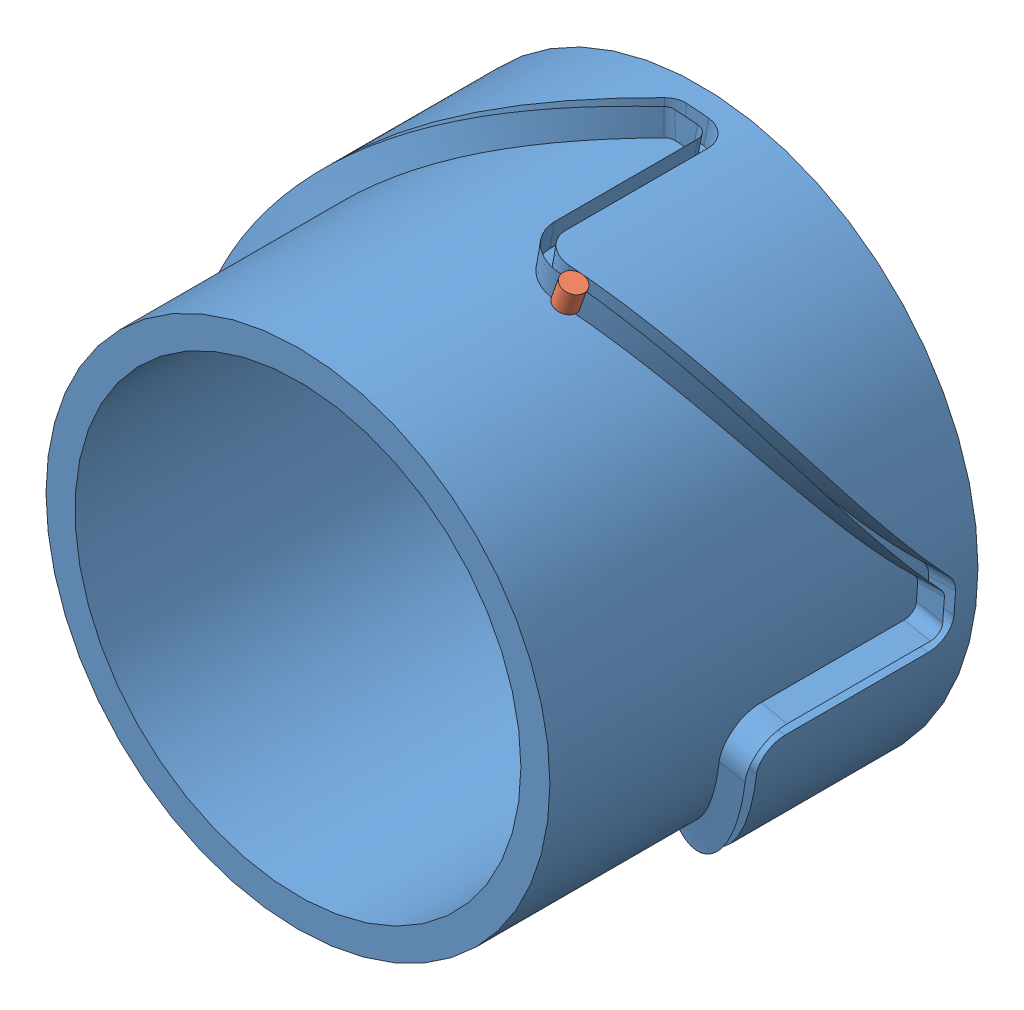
SolidWorks assembly Baugruppe_test.SLDASM, configuration Standard (file format 4100). Lengths in mm.
Overall size (254.39 254.4 180).
2 component instances, 2 part files, 3 mates.
Components (placement in the parent):
- umwickeln1-1: umwickeln1.SLDPRT [Default] at (-19.7958 -21.3015 90) size (254.39 254.4 180)
- rolle-1: rolle.SLDPRT [Standard] at (18.4404 87.1606 7.9218) x (-0.943112 0.332476 0) z (0 0 -1) size (10 10 10)
Mates (geometry in assembly coordinates):
- Senkrecht1: perpendicular: line of umwickeln1-1 through (-19.7958 -21.3015 -90) axis (0 0 1); axis of rolle-1 through (21.7651 96.5917 7.9218) axis (-0.332476 -0.943112 0)
- Deckungsgleich2: coincident: line of umwickeln1-1 through (-19.7958 -21.3015 -90) axis (0 0 1); plane of rolle-1
- BahnVerknüpfung1: path: point of rolle-1; curve of umwickeln1-1
